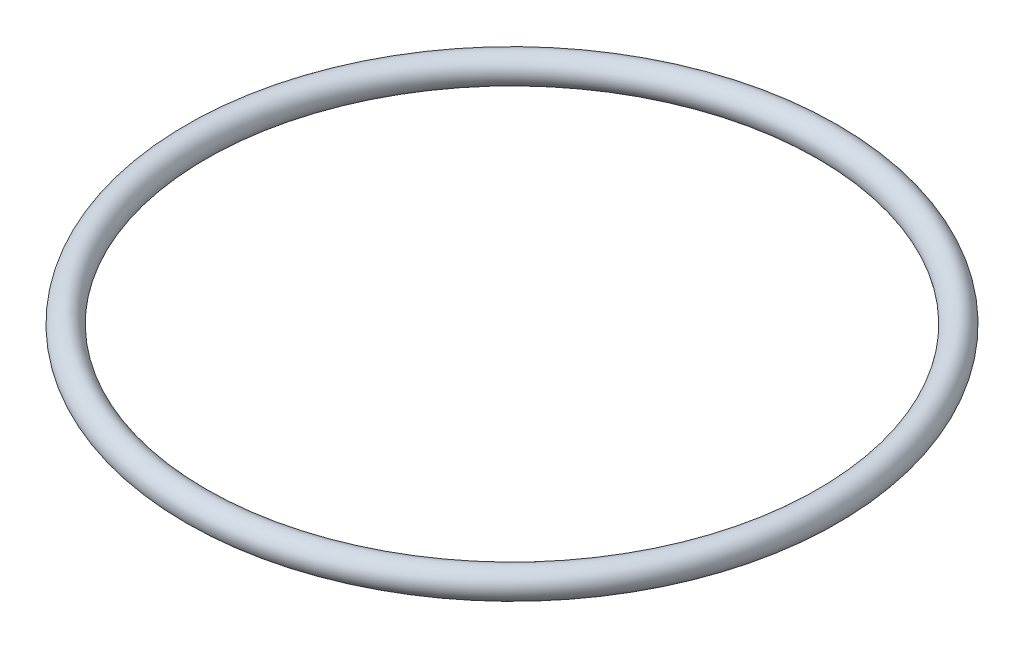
ISO-10303-21;
HEADER;
FILE_DESCRIPTION(('STEP AP214'),'2;1');
FILE_NAME('part.step','',(''),(''),'','','');
FILE_SCHEMA(('AUTOMOTIVE_DESIGN { 1 0 10303 214 1 1 1 1 }'));
ENDSEC;
DATA;
#1=APPLICATION_CONTEXT('core data for automotive mechanical design processes');
#2=APPLICATION_PROTOCOL_DEFINITION('international standard','automotive_design',2000,#1);
#3=PRODUCT_CONTEXT('',#1,'mechanical');
#4=PRODUCT('Part','Part','',(#3));
#5=PRODUCT_RELATED_PRODUCT_CATEGORY('part','',(#4));
#6=PRODUCT_DEFINITION_FORMATION('','',#4);
#7=PRODUCT_DEFINITION_CONTEXT('part definition',#1,'design');
#8=PRODUCT_DEFINITION('design','',#6,#7);
#9=PRODUCT_DEFINITION_SHAPE('','',#8);
#10=(LENGTH_UNIT() NAMED_UNIT(*) SI_UNIT(.MILLI.,.METRE.));
#11=(NAMED_UNIT(*) PLANE_ANGLE_UNIT() SI_UNIT($,.RADIAN.));
#12=(NAMED_UNIT(*) SI_UNIT($,.STERADIAN.) SOLID_ANGLE_UNIT());
#13=UNCERTAINTY_MEASURE_WITH_UNIT(LENGTH_MEASURE(1.E-05),#10,'distance_accuracy_value','');
#14=(GEOMETRIC_REPRESENTATION_CONTEXT(3) GLOBAL_UNCERTAINTY_ASSIGNED_CONTEXT((#13)) GLOBAL_UNIT_ASSIGNED_CONTEXT((#10,
#11,#12)) REPRESENTATION_CONTEXT('',''));
#15=CARTESIAN_POINT('',(0.,0.,0.));
#16=DIRECTION('',(0.,0.,1.));
#17=DIRECTION('',(1.,0.,0.));
#18=AXIS2_PLACEMENT_3D('',#15,#16,#17);
#19=CARTESIAN_POINT('',(0.,3.49499999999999,0.));
#20=DIRECTION('',(0.,-1.,0.));
#21=DIRECTION('',(0.,0.,-1.));
#22=AXIS2_PLACEMENT_3D('',#19,#20,#21);
#23=TOROIDAL_SURFACE('',#22,79.38,3.495);
#24=CARTESIAN_POINT('',(0.,3.49499999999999,-82.875));
#25=VERTEX_POINT('',#24);
#26=VERTEX_LOOP('',#25);
#27=FACE_BOUND('',#26,.T.);
#28=ADVANCED_FACE('F26',(#27),#23,.T.);
#29=CLOSED_SHELL('',(#28));
#30=MANIFOLD_SOLID_BREP('B2',#29);
#31=ADVANCED_BREP_SHAPE_REPRESENTATION('',(#18,#30),#14);
#32=SHAPE_DEFINITION_REPRESENTATION(#9,#31);
ENDSEC;
END-ISO-10303-21;
